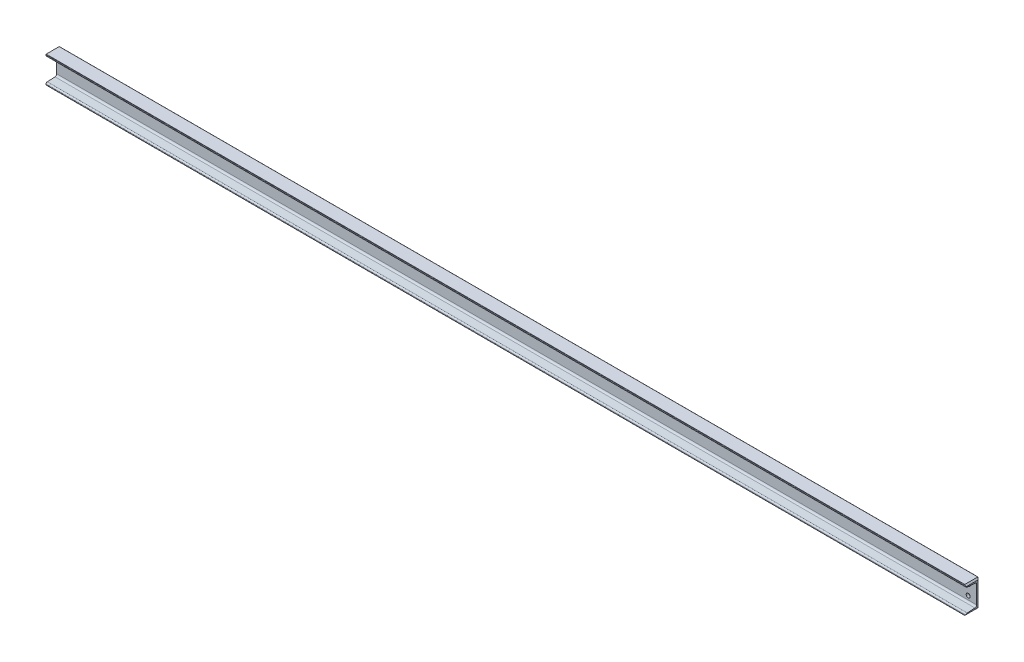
from build123d import *

# Parameters (mm, degrees)
ESQUISSE1_W                   = 2060
ESQUISSE1_H                   = 60
BOSS_EXTRU_1_DEPTH            = 30
ESQUISSE2_W                   = 24
ESQUISSE2_H                   = 47.602680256
ENL_V_MAT_EXTRU_1_DEPTH       = 2061.436846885
D_POUILLE1_ANGLE              = 3
DIAM_TRE_DU_PER_AGE_9_0_9_1_D = 9
CHANFREIN1_SIZE               = 3
CONG_1_R                      = 0.5
CONG_2_R                      = 3
CONG_3_R                      = 4


with BuildPart() as part:
    # Esquisse1 → Boss.-Extru.1 (new body)
    with BuildSketch(Plane.XY.offset(30)):
        Rectangle(ESQUISSE1_W, ESQUISSE1_H)
    extrude(amount=-BOSS_EXTRU_1_DEPTH)

    # Esquisse2 → Enl_v. mat.-Extru.1 (cut, through all)
    with BuildSketch(Plane.ZY.offset(1030)):
        with Locations((18, 0)):
            Rectangle(ESQUISSE2_W, ESQUISSE2_H)
    extrude(amount=-ENL_V_MAT_EXTRU_1_DEPTH, mode=Mode.SUBTRACT)

    # D_pouille1
    d_pouille1_faces = [part.faces().sort_by_distance(p)[0] for p in [
        (0, -23.801340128, 18),
        (0, 23.801340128, 18),
    ]]
    draft(d_pouille1_faces, Plane(origin=(1030, 23.801340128, 6), x_dir=(1, 0, 0), z_dir=(0, 0, 1)), D_POUILLE1_ANGLE)

    # Diam_tre du per_age _9.0 _9_1 (through all)
    with Locations(Plane.XY.offset(6)):
        with Locations((1011, -11.25), (1011, 11.25)):
            Hole(DIAM_TRE_DU_PER_AGE_9_0_9_1_D / 2)

    # Chanfrein1
    chanfrein1_edges = [part.edges().sort_by_distance(p)[0] for p in [
        (1030, 0, 0),
        (1030, 30, 15),
        (1030, -30, 15),
    ]]
    chamfer(chanfrein1_edges, length=CHANFREIN1_SIZE)

    # Cong_1
    cong_1_edges = [part.edges().sort_by_distance(p)[0] for p in [
        (-1.5, -30, 0),
        (-1.5, 30, 30),
        (-1.5, 30, 0),
        (-1.5, -30, 30),
    ]]
    fillet(cong_1_edges, radius=CONG_1_R)

    # Cong_2
    cong_2_edges = [part.edges().sort_by_distance(p)[0] for p in [
        (0, -25.059126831, 30),
        (0, 25.059126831, 30),
    ]]
    fillet(cong_2_edges, radius=CONG_2_R)

    # Cong_3
    cong_3_edges = [part.edges().sort_by_distance(p)[0] for p in [
        (0, -23.801340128, 6),
        (0, 23.801340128, 6),
    ]]
    fillet(cong_3_edges, radius=CONG_3_R)


solid = part.part
